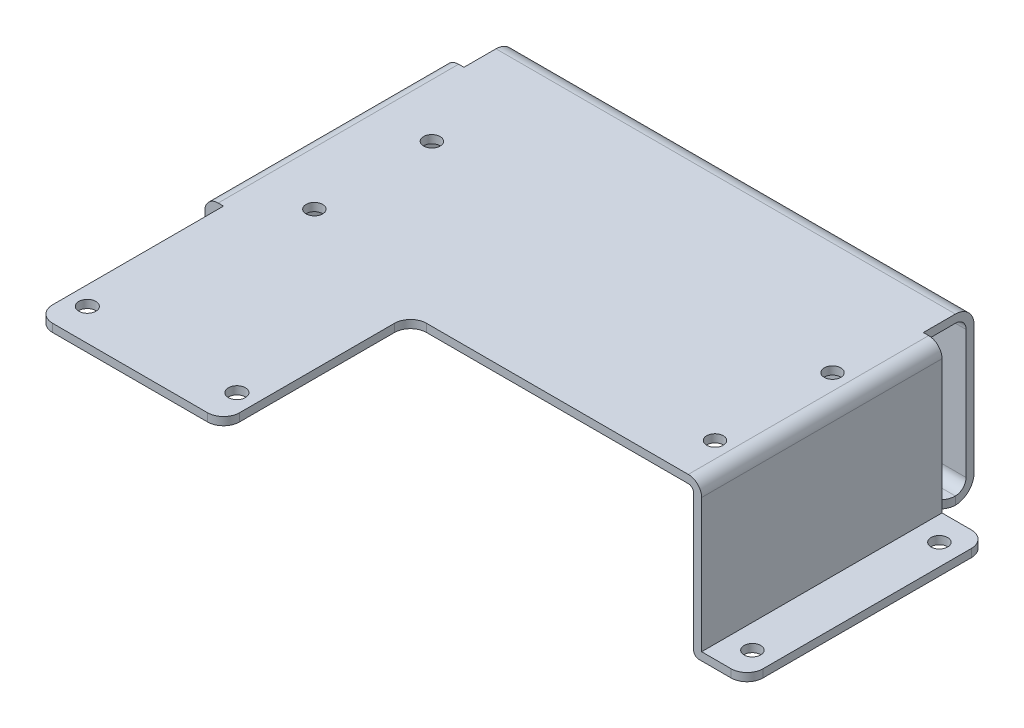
from build123d import *

# Parameters (mm, degrees)
EXTRUDE_1_DEPTH     = 22.5
SKETCH_3_R          = 1.55
CUT_EXTRUDE_1_DEPTH = 45
EXTRUDE_2_DEPTH     = 43
SKETCH_7_W          = 35
SKETCH_7_H          = 1.5
EXTRUDE_1_2_DEPTH   = 35
SKETCH_8_R          = 1.6
CUT_EXTRUDE_3_DEPTH = 15
FILLET_1_R          = 3
FILLET_2_R          = 3


with BuildPart() as part:
    # Sketch 1 → Extrude 1 (new, symmetric)
    with BuildSketch(Plane.XY):
        with BuildLine():
            Line((-55, 0), (-46, 0))
            ThreePointArc((-46, 0), (-45.292893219, 0.292893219), (-45, 1))
            Line((-45, 1), (-45, 26.5))
            ThreePointArc((-45, 26.5), (-44.707106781, 27.207106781), (-44, 27.5))
            Line((-44, 27.5), (44, 27.5))
            ThreePointArc((44, 27.5), (44.707106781, 27.207106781), (45, 26.5))
            Line((45, 26.5), (45, 1))
            ThreePointArc((45, 1), (45.292893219, 0.292893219), (46, 0))
            Line((46, 0), (55, 0))
            Line((55, 0), (55, 1.5))
            Line((55, 1.5), (46.5, 1.5))
            Line((46.5, 1.5), (46.5, 26.5))
            ThreePointArc((46.5, 26.5), (45.767766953, 28.267766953), (44, 29))
            Line((44, 29), (-44, 29))
            ThreePointArc((-44, 29), (-45.767766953, 28.267766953), (-46.5, 26.5))
            Line((-46.5, 26.5), (-46.5, 1.5))
            Line((-46.5, 1.5), (-55, 1.5))
            Line((-55, 1.5), (-55, 0))
        make_face()
    extrude(amount=EXTRUDE_1_DEPTH, both=True)

    # Sketch 3 → Cut-Extrude 1 (cut)
    with BuildSketch(Plane(origin=(0, 29, 0), x_dir=(1, 0, 0), z_dir=(0, 1, 0))):
        with Locations(Location((-34, 7.5, 0), (0, 0, 180))):
            Circle(SKETCH_3_R)
        with Locations(Location((41, 7.5, 0), (0, 0, 180))):
            Circle(SKETCH_3_R)
        with Locations(Location((41, -14.5, 0), (0, 0, 180))):
            Circle(SKETCH_3_R)
        with Locations(Location((-34, -14.5, 0), (0, 0, 180))):
            Circle(SKETCH_3_R)
        with Locations(Location((-51, 17.5, 0), (0, 0, 180))):
            Circle(SKETCH_3_R)
        with Locations(Location((51, 17.5, 0), (0, 0, 180))):
            Circle(SKETCH_3_R)
        with Locations(Location((-51, -17.5, 0), (0, 0, 180))):
            Circle(SKETCH_3_R)
        with Locations(Location((51, -17.5, 0), (0, 0, 180))):
            Circle(SKETCH_3_R)
    extrude(amount=-CUT_EXTRUDE_1_DEPTH, mode=Mode.SUBTRACT)

    # Sketch 4 → Extrude 2 (add, symmetric)
    with BuildSketch(Plane(origin=(0, 0, 0), x_dir=(0, 0, -1), z_dir=(1, 0, 0))):
        with BuildLine():
            Line((22.5, 27.5), (28.5, 27.5))
            ThreePointArc((28.5, 27.5), (29.914213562, 26.914213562), (30.5, 25.5))
            Line((30.5, 25.5), (30.5, 1.5))
            ThreePointArc((30.5, 1.5), (29.914213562, 0.085786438), (28.5, -0.5))
            Line((28.5, -0.5), (25.5, -0.5))
            Line((25.5, -0.5), (25.5, -2))
            Line((25.5, -2), (28.5, -2))
            ThreePointArc((28.5, -2), (30.974873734, -0.974873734), (32, 1.5))
            Line((32, 1.5), (32, 25.5))
            ThreePointArc((32, 25.5), (30.974873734, 27.974873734), (28.5, 29))
            Line((28.5, 29), (22.5, 29))
            Line((22.5, 29), (22.5, 27.5))
        make_face()
    extrude(amount=EXTRUDE_2_DEPTH, both=True)

    # Sketch 7 → Extrude 1 2 (add)
    with BuildSketch(Plane.XY.offset(22.5)):
        with Locations((-25.5, 28.25)):
            Rectangle(SKETCH_7_W, SKETCH_7_H)
    extrude(amount=EXTRUDE_1_2_DEPTH)

    # Sketch 8 → Cut-Extrude 3 (cut)
    with BuildSketch(Plane(origin=(0, 29, 0), x_dir=(1, 0, 0), z_dir=(0, 1, 0))):
        with Locations(Location((-39.5, -51.5, 0), (0, 0, 270))):
            Circle(SKETCH_8_R)
        with Locations(Location((-11.5, -51.5, 0), (0, 0, 270))):
            Circle(SKETCH_8_R)
    extrude(amount=-CUT_EXTRUDE_3_DEPTH, mode=Mode.SUBTRACT)

    # Fillet 1
    fillet_1_edges = [part.edges().sort_by_distance(p)[0] for p in [
        (43, -1.25, -25.5),
        (55, 0.75, -22.5),
        (55, 0.75, 22.5),
        (-43, -1.25, -25.5),
        (-55, 0.75, -22.5),
        (-55, 0.75, 22.5),
        (-8, 28.25, 57.5),
        (-43, 28.25, 57.5),
    ]]
    fillet(fillet_1_edges, radius=FILLET_1_R)

    # Fillet 2
    fillet_2_edges = [part.edges().sort_by_distance(p)[0] for p in [
        (-8, 28.25, 22.5),
    ]]
    fillet(fillet_2_edges, radius=FILLET_2_R)


solid = part.part
